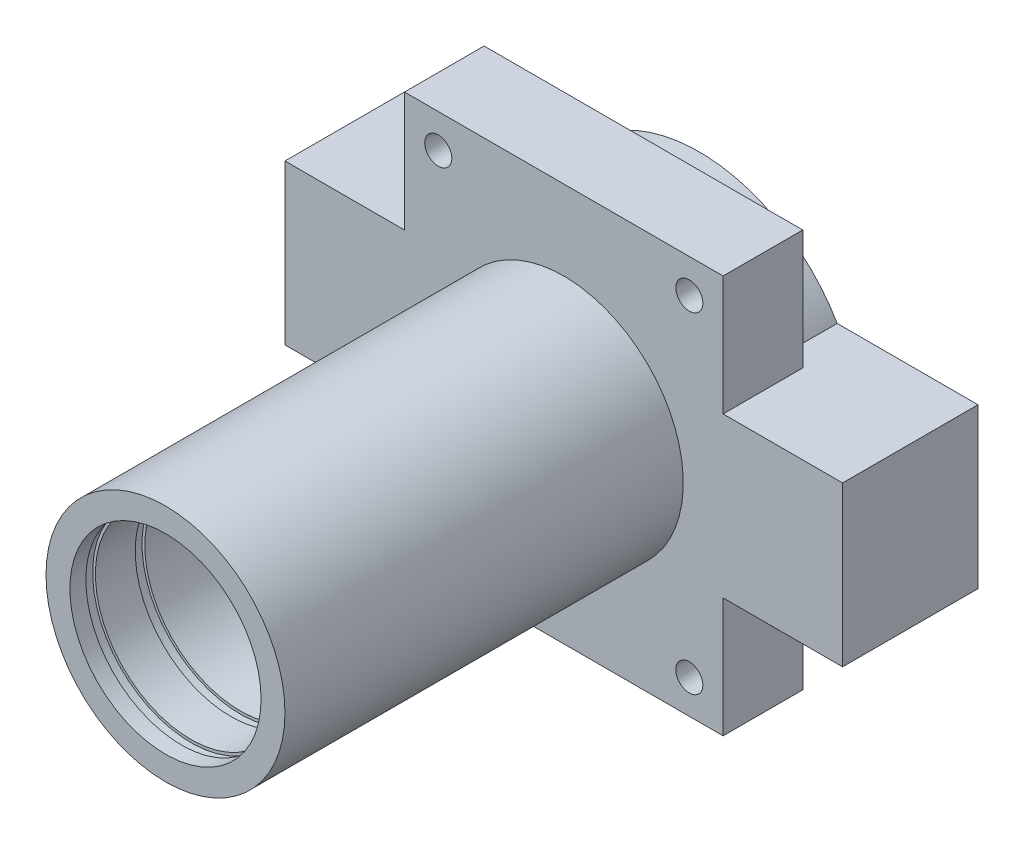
from build123d import *

# Parameters (mm, degrees)
SKETCH1_W                                           = 40
SKETCH1_H                                           = 50
BOSS_EXTRUDE1_DEPTH                                 = 10
SKETCH3_R                                           = 7.5
CUT_EXTRUDE1_DEPTH                                  = 10
SKETCH4_R                                           = 20
BOSS_EXTRUDE2_DEPTH                                 = 7
SKETCH6_R                                           = 18.5
CUT_EXTRUDE3_DEPTH                                  = 9
SKETCH7_W                                           = 10
SKETCH7_H                                           = 20
BOSS_EXTRUDE3_DEPTH                                 = 15
BOSS_EXTRUDE4_DEPTH                                 = 7
CSK_FOR_M3_COUNTERSUNK_FLAT_HEAD_SCREW1_D           = 3.4
CSK_FOR_M3_COUNTERSUNK_FLAT_HEAD_SCREW1_CSINK_D     = 6.3
CSK_FOR_M3_COUNTERSUNK_FLAT_HEAD_SCREW1_CSINK_ANGLE = 90
M5_CLEARANCE_HOLE1_D                                = 5.5
M5_CLEARANCE_HOLE1_DEPTH                            = 7
M5_CLEARANCE_HOLE1_TIP                              = 1.652366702
SKETCH14_R                                          = 15
SKETCH14_R_2                                        = 12
BOSS_EXTRUDE5_DEPTH                                 = 50
SKETCH15_R                                          = 12.345
CUT_EXTRUDE4_DEPTH                                  = 1.2
LPATTERN1_COUNT                                     = 2
LPATTERN1_PITCH                                     = 6.2


with BuildPart() as part:
    # Sketch1 → Boss-Extrude1 (new body)
    with BuildSketch(Plane.XY):
        with Locations((20, 25)):
            Rectangle(SKETCH1_W, SKETCH1_H)
    extrude(amount=BOSS_EXTRUDE1_DEPTH)

    # Sketch3 → Cut-Extrude1 (cut)
    with BuildSketch(Plane(origin=(0, 0, 0), x_dir=(-1, 0, 0), z_dir=(0, 0, -1))):
        with Locations((-20, 25)):
            Circle(SKETCH3_R)
    extrude(amount=-CUT_EXTRUDE1_DEPTH, mode=Mode.SUBTRACT)

    # Sketch4 → Boss-Extrude2 (add)
    with BuildSketch(Plane(origin=(0, 0, 0), x_dir=(-1, 0, 0), z_dir=(0, 0, -1))):
        with Locations((-20, 25)):
            Circle(SKETCH4_R)
    extrude(amount=BOSS_EXTRUDE2_DEPTH)

    # Sketch6 → Cut-Extrude3 (cut)
    with BuildSketch(Plane(origin=(0, 0, -7), x_dir=(-1, 0, 0), z_dir=(0, 0, -1))):
        with Locations((-20, 25)):
            Circle(SKETCH6_R)
    extrude(amount=-CUT_EXTRUDE3_DEPTH, mode=Mode.SUBTRACT)

    # Sketch7 → Boss-Extrude3 (add)
    with BuildSketch(Plane.ZY):
        with Locations((5, 25)):
            Rectangle(SKETCH7_W, SKETCH7_H)
    boss_extrude3 = extrude(amount=BOSS_EXTRUDE3_DEPTH)

    # Mirror1: Boss-Extrude3 across plane
    add(boss_extrude3.mirror(Plane.ZY.offset(-20)))

    # Sketch9 → Boss-Extrude4 (add)
    with BuildSketch(Plane(origin=(0, 0, 0), x_dir=(-1, 0, 0), z_dir=(0, 0, -1))):
        with BuildLine():
            Line((0, 15), (15, 15))
            Line((15, 15), (15, 35))
            Line((15, 35), (0, 35))
            Line((0, 35), (-2.679491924, 35))
            ThreePointArc((-2.679491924, 35), (-0.681483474, 30.176380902), (0, 25))
            ThreePointArc((0, 25), (-0.681483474, 19.823619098), (-2.679491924, 15))
            Line((-2.679491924, 15), (0, 15))
        make_face()
    boss_extrude4 = extrude(amount=BOSS_EXTRUDE4_DEPTH)

    # Mirror2: Boss-Extrude4 across plane
    add(boss_extrude4.mirror(Plane.ZY.offset(-20)))

    # CSK for M3 Countersunk Flat Head Screw1 (through all)
    with Locations(Plane(origin=(4.242640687, 4.242640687, 0), x_dir=(-1, 0, 0), z_dir=(0, 0, -1))):
        with Locations((0, 0), (-31.514718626, 0), (-31.514718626, 41.514718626), (0, 41.514718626)):
            CounterSinkHole(CSK_FOR_M3_COUNTERSUNK_FLAT_HEAD_SCREW1_D / 2, CSK_FOR_M3_COUNTERSUNK_FLAT_HEAD_SCREW1_CSINK_D / 2, counter_sink_angle=CSK_FOR_M3_COUNTERSUNK_FLAT_HEAD_SCREW1_CSINK_ANGLE)

    # M5 Clearance Hole1
    with Locations(Plane(origin=(47, 25, -7), x_dir=(-1, 0, 0), z_dir=(0, 0, -1))):
        with Locations((0, 0), (54, 0)):
            Hole(M5_CLEARANCE_HOLE1_D / 2, depth=M5_CLEARANCE_HOLE1_DEPTH)
            with Locations((0, 0, -(M5_CLEARANCE_HOLE1_DEPTH + M5_CLEARANCE_HOLE1_TIP / 2))):  # 118° drill point
                Cone(0, M5_CLEARANCE_HOLE1_D / 2, M5_CLEARANCE_HOLE1_TIP, mode=Mode.SUBTRACT)

    # Sketch14 → Boss-Extrude5 (add)
    with BuildSketch(Plane.XY.offset(10)):
        with Locations(Location((20, 25, 0), (0, 0, 180))):
            Circle(SKETCH14_R)
        with Locations((20, 25)):
            Circle(SKETCH14_R_2, mode=Mode.SUBTRACT)
    extrude(amount=BOSS_EXTRUDE5_DEPTH)

    # Sketch15 → Cut-Extrude4 (cut)
    with BuildSketch(Plane.XY.offset(58)):
        with Locations((20, 25)):
            Circle(SKETCH15_R)
    cut_extrude4 = extrude(amount=-CUT_EXTRUDE4_DEPTH, mode=Mode.SUBTRACT)

    # LPattern1: Cut-Extrude4 ×2
    with Locations(*[(0, 0, -i * LPATTERN1_PITCH) for i in range(1, LPATTERN1_COUNT)]):
        add(cut_extrude4, mode=Mode.SUBTRACT)


solid = part.part
